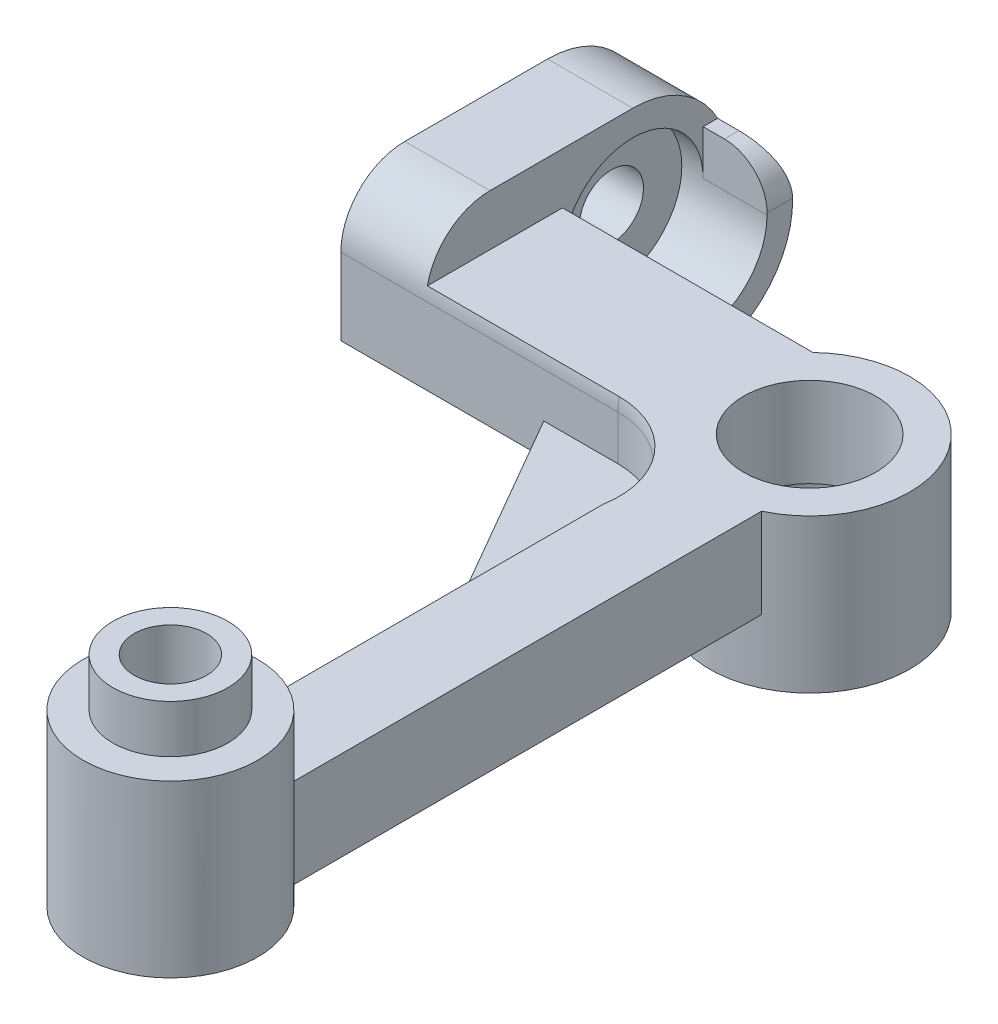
ISO-10303-21;
HEADER;
FILE_DESCRIPTION(('STEP AP214'),'2;1');
FILE_NAME('part.step','',(''),(''),'','','');
FILE_SCHEMA(('AUTOMOTIVE_DESIGN { 1 0 10303 214 1 1 1 1 }'));
ENDSEC;
DATA;
#1=APPLICATION_CONTEXT('core data for automotive mechanical design processes');
#2=APPLICATION_PROTOCOL_DEFINITION('international standard','automotive_design',2000,#1);
#3=PRODUCT_CONTEXT('',#1,'mechanical');
#4=PRODUCT('Part','Part','',(#3));
#5=PRODUCT_RELATED_PRODUCT_CATEGORY('part','',(#4));
#6=PRODUCT_DEFINITION_FORMATION('','',#4);
#7=PRODUCT_DEFINITION_CONTEXT('part definition',#1,'design');
#8=PRODUCT_DEFINITION('design','',#6,#7);
#9=PRODUCT_DEFINITION_SHAPE('','',#8);
#10=(LENGTH_UNIT() NAMED_UNIT(*) SI_UNIT(.MILLI.,.METRE.));
#11=(NAMED_UNIT(*) PLANE_ANGLE_UNIT() SI_UNIT($,.RADIAN.));
#12=(NAMED_UNIT(*) SI_UNIT($,.STERADIAN.) SOLID_ANGLE_UNIT());
#13=UNCERTAINTY_MEASURE_WITH_UNIT(LENGTH_MEASURE(1.E-05),#10,'distance_accuracy_value','');
#14=(GEOMETRIC_REPRESENTATION_CONTEXT(3) GLOBAL_UNCERTAINTY_ASSIGNED_CONTEXT((#13)) GLOBAL_UNIT_ASSIGNED_CONTEXT((#10,
#11,#12)) REPRESENTATION_CONTEXT('',''));
#15=CARTESIAN_POINT('',(0.,0.,0.));
#16=DIRECTION('',(0.,0.,1.));
#17=DIRECTION('',(1.,0.,0.));
#18=AXIS2_PLACEMENT_3D('',#15,#16,#17);
#19=CARTESIAN_POINT('',(0.,0.,30.));
#20=DIRECTION('',(0.,1.,0.));
#21=DIRECTION('',(0.,0.,1.));
#22=AXIS2_PLACEMENT_3D('',#19,#20,#21);
#23=PLANE('',#22);
#24=CARTESIAN_POINT('',(0.,0.,30.));
#25=DIRECTION('',(0.,1.,0.));
#26=DIRECTION('',(0.,0.,1.));
#27=AXIS2_PLACEMENT_3D('',#24,#25,#26);
#28=CIRCLE('',#27,1.7);
#29=CARTESIAN_POINT('',(0.,0.,31.7));
#30=VERTEX_POINT('',#29);
#31=EDGE_CURVE('E344',#30,#30,#28,.T.);
#32=ORIENTED_EDGE('',*,*,#31,.T.);
#33=EDGE_LOOP('',(#32));
#34=FACE_BOUND('',#33,.T.);
#35=DIRECTION('',(1.,0.,0.));
#36=VECTOR('',#35,1.);
#37=CARTESIAN_POINT('',(-19.,0.,-2.72005025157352));
#38=LINE('',#37,#36);
#39=CARTESIAN_POINT('',(-19.,0.,-2.72005025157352));
#40=VERTEX_POINT('',#39);
#41=CARTESIAN_POINT('',(-12.,0.,-2.72005025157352));
#42=VERTEX_POINT('',#41);
#43=EDGE_CURVE('E236',#40,#42,#38,.T.);
#44=ORIENTED_EDGE('',*,*,#43,.T.);
#45=DIRECTION('',(0.,0.,-1.));
#46=VECTOR('',#45,1.);
#47=CARTESIAN_POINT('',(-12.,0.,30.));
#48=LINE('',#47,#46);
#49=CARTESIAN_POINT('',(-12.,0.,-3.4));
#50=VERTEX_POINT('',#49);
#51=EDGE_CURVE('E207',#42,#50,#48,.T.);
#52=ORIENTED_EDGE('',*,*,#51,.T.);
#53=DIRECTION('',(-1.,0.,0.));
#54=VECTOR('',#53,1.);
#55=CARTESIAN_POINT('',(-3.2449961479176,0.,-3.4));
#56=LINE('',#55,#54);
#57=CARTESIAN_POINT('',(-3.2449961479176,0.,-3.4));
#58=VERTEX_POINT('',#57);
#59=EDGE_CURVE('E264',#58,#50,#56,.T.);
#60=ORIENTED_EDGE('',*,*,#59,.F.);
#61=CARTESIAN_POINT('',(0.,0.,0.));
#62=DIRECTION('',(0.,-1.,0.));
#63=DIRECTION('',(0.,0.,-1.));
#64=AXIS2_PLACEMENT_3D('',#61,#62,#63);
#65=CIRCLE('',#64,4.7);
#66=CARTESIAN_POINT('',(2.,0.,4.25323406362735));
#67=VERTEX_POINT('',#66);
#68=EDGE_CURVE('E240',#67,#58,#65,.T.);
#69=ORIENTED_EDGE('',*,*,#68,.F.);
#70=DIRECTION('',(0.,0.,-1.));
#71=VECTOR('',#70,1.);
#72=CARTESIAN_POINT('',(2.,0.,4.25323406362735));
#73=LINE('',#72,#71);
#74=CARTESIAN_POINT('',(2.,0.,26.4208939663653));
#75=VERTEX_POINT('',#74);
#76=EDGE_CURVE('E268',#75,#67,#73,.T.);
#77=ORIENTED_EDGE('',*,*,#76,.F.);
#78=CARTESIAN_POINT('',(0.,0.,30.));
#79=DIRECTION('',(0.,1.,0.));
#80=DIRECTION('',(0.,0.,1.));
#81=AXIS2_PLACEMENT_3D('',#78,#79,#80);
#82=CIRCLE('',#81,4.1);
#83=CARTESIAN_POINT('',(-2.,0.,26.4208939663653));
#84=VERTEX_POINT('',#83);
#85=EDGE_CURVE('E273',#84,#75,#82,.T.);
#86=ORIENTED_EDGE('',*,*,#85,.F.);
#87=DIRECTION('',(0.,0.,1.));
#88=VECTOR('',#87,1.);
#89=CARTESIAN_POINT('',(-2.,0.,7.00000000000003));
#90=LINE('',#89,#88);
#91=CARTESIAN_POINT('',(-2.,0.,15.95));
#92=VERTEX_POINT('',#91);
#93=EDGE_CURVE('E329',#92,#84,#90,.T.);
#94=ORIENTED_EDGE('',*,*,#93,.F.);
#95=DIRECTION('',(-0.500000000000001,0.,-0.866025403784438));
#96=VECTOR('',#95,1.);
#97=CARTESIAN_POINT('',(-9.47668598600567,0.,3.));
#98=LINE('',#97,#96);
#99=CARTESIAN_POINT('',(-9.47668598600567,0.,3.));
#100=VERTEX_POINT('',#99);
#101=EDGE_CURVE('E247',#92,#100,#98,.T.);
#102=ORIENTED_EDGE('',*,*,#101,.T.);
#103=DIRECTION('',(1.,0.,0.));
#104=VECTOR('',#103,1.);
#105=CARTESIAN_POINT('',(-6.00000000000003,0.,3.));
#106=LINE('',#105,#104);
#107=CARTESIAN_POINT('',(-19.,0.,3.00000000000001));
#108=VERTEX_POINT('',#107);
#109=EDGE_CURVE('E267',#108,#100,#106,.T.);
#110=ORIENTED_EDGE('',*,*,#109,.F.);
#111=DIRECTION('',(0.,0.,1.));
#112=VECTOR('',#111,1.);
#113=CARTESIAN_POINT('',(-19.,0.,-2.72005025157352));
#114=LINE('',#113,#112);
#115=EDGE_CURVE('E223',#40,#108,#114,.T.);
#116=ORIENTED_EDGE('',*,*,#115,.F.);
#117=EDGE_LOOP('',(#44,#52,#60,#69,#77,#86,#94,#102,#110,#116));
#118=FACE_BOUND('',#117,.T.);
#119=ADVANCED_FACE('F35',(#34,#118),#23,.F.);
#120=CARTESIAN_POINT('',(-15.,2.1,-6.7));
#121=DIRECTION('',(-1.,0.,0.));
#122=DIRECTION('',(0.,0.,1.));
#123=AXIS2_PLACEMENT_3D('',#120,#121,#122);
#124=PLANE('',#123);
#125=DIRECTION('',(0.,0.,-1.));
#126=VECTOR('',#125,1.);
#127=CARTESIAN_POINT('',(-15.,6.6,-6.7));
#128=LINE('',#127,#126);
#129=CARTESIAN_POINT('',(-15.,6.6,0.));
#130=VERTEX_POINT('',#129);
#131=CARTESIAN_POINT('',(-15.,6.6,-6.7));
#132=VERTEX_POINT('',#131);
#133=EDGE_CURVE('E224',#130,#132,#128,.T.);
#134=ORIENTED_EDGE('',*,*,#133,.F.);
#135=CARTESIAN_POINT('',(-15.,3.6,0.));
#136=DIRECTION('',(-1.,0.,0.));
#137=DIRECTION('',(0.,0.,1.));
#138=AXIS2_PLACEMENT_3D('',#135,#136,#137);
#139=CIRCLE('',#138,3.);
#140=CARTESIAN_POINT('',(-15.,4.2,2.93938769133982));
#141=VERTEX_POINT('',#140);
#142=EDGE_CURVE('E302',#130,#141,#139,.F.);
#143=ORIENTED_EDGE('',*,*,#142,.T.);
#144=DIRECTION('',(0.,0.,1.));
#145=VECTOR('',#144,1.);
#146=CARTESIAN_POINT('',(-15.,4.2,3.00000000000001));
#147=LINE('',#146,#145);
#148=CARTESIAN_POINT('',(-15.,4.2,-3.4));
#149=VERTEX_POINT('',#148);
#150=EDGE_CURVE('E281',#149,#141,#147,.T.);
#151=ORIENTED_EDGE('',*,*,#150,.F.);
#152=DIRECTION('',(0.,-1.,0.));
#153=VECTOR('',#152,1.);
#154=CARTESIAN_POINT('',(-15.,4.2,-3.4));
#155=LINE('',#154,#153);
#156=CARTESIAN_POINT('',(-15.,2.1,-3.4));
#157=VERTEX_POINT('',#156);
#158=EDGE_CURVE('E261',#149,#157,#155,.T.);
#159=ORIENTED_EDGE('',*,*,#158,.T.);
#160=CARTESIAN_POINT('',(-15.,2.1,-6.7));
#161=DIRECTION('',(1.,0.,0.));
#162=DIRECTION('',(0.,0.,-1.));
#163=AXIS2_PLACEMENT_3D('',#160,#161,#162);
#164=CIRCLE('',#163,3.3);
#165=CARTESIAN_POINT('',(-15.,2.1,-9.99999999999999));
#166=VERTEX_POINT('',#165);
#167=EDGE_CURVE('E210',#166,#157,#164,.T.);
#168=ORIENTED_EDGE('',*,*,#167,.F.);
#169=DIRECTION('',(0.,-1.,0.));
#170=VECTOR('',#169,1.);
#171=CARTESIAN_POINT('',(-15.,2.1,-9.99999999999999));
#172=LINE('',#171,#170);
#173=CARTESIAN_POINT('',(-15.,4.2,-9.99999999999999));
#174=VERTEX_POINT('',#173);
#175=EDGE_CURVE('E186',#174,#166,#172,.T.);
#176=ORIENTED_EDGE('',*,*,#175,.F.);
#177=DIRECTION('',(0.,0.,1.));
#178=VECTOR('',#177,1.);
#179=CARTESIAN_POINT('',(-15.,4.2,-9.99999999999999));
#180=LINE('',#179,#178);
#181=CARTESIAN_POINT('',(-15.,4.2,-10.6799497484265));
#182=VERTEX_POINT('',#181);
#183=EDGE_CURVE('E199',#182,#174,#180,.T.);
#184=ORIENTED_EDGE('',*,*,#183,.F.);
#185=CARTESIAN_POINT('',(-15.,2.1,-6.7));
#186=DIRECTION('',(-1.,0.,0.));
#187=DIRECTION('',(0.,0.,1.));
#188=AXIS2_PLACEMENT_3D('',#185,#186,#187);
#189=CIRCLE('',#188,4.5);
#190=EDGE_CURVE('E219',#132,#182,#189,.T.);
#191=ORIENTED_EDGE('',*,*,#190,.F.);
#192=EDGE_LOOP('',(#134,#143,#151,#159,#168,#176,#184,#191));
#193=FACE_BOUND('',#192,.T.);
#194=ADVANCED_FACE('F437',(#193),#124,.F.);
#195=CARTESIAN_POINT('',(-19.,2.1,-6.7));
#196=DIRECTION('',(1.,0.,0.));
#197=DIRECTION('',(0.,0.,-1.));
#198=AXIS2_PLACEMENT_3D('',#195,#196,#197);
#199=CYLINDRICAL_SURFACE('',#198,1.5);
#200=CARTESIAN_POINT('',(-19.,2.1,-6.7));
#201=DIRECTION('',(-1.,0.,0.));
#202=DIRECTION('',(0.,0.,1.));
#203=AXIS2_PLACEMENT_3D('',#200,#201,#202);
#204=CIRCLE('',#203,1.5);
#205=CARTESIAN_POINT('',(-19.,2.1,-5.2));
#206=VERTEX_POINT('',#205);
#207=EDGE_CURVE('E216',#206,#206,#204,.T.);
#208=ORIENTED_EDGE('',*,*,#207,.T.);
#209=EDGE_LOOP('',(#208));
#210=FACE_BOUND('',#209,.T.);
#211=CARTESIAN_POINT('',(-16.,2.1,-6.7));
#212=DIRECTION('',(1.,0.,0.));
#213=DIRECTION('',(0.,0.,-1.));
#214=AXIS2_PLACEMENT_3D('',#211,#212,#213);
#215=CIRCLE('',#214,1.5);
#216=CARTESIAN_POINT('',(-16.,2.1,-8.2));
#217=VERTEX_POINT('',#216);
#218=EDGE_CURVE('E214',#217,#217,#215,.T.);
#219=ORIENTED_EDGE('',*,*,#218,.T.);
#220=EDGE_LOOP('',(#219));
#221=FACE_BOUND('',#220,.T.);
#222=ADVANCED_FACE('F442',(#210,#221),#199,.F.);
#223=CARTESIAN_POINT('',(0.,0.,0.));
#224=DIRECTION('',(0.,1.,0.));
#225=DIRECTION('',(0.,0.,1.));
#226=AXIS2_PLACEMENT_3D('',#223,#224,#225);
#227=CIRCLE('',#226,3.1);
#228=CARTESIAN_POINT('',(0.,0.,3.1));
#229=VERTEX_POINT('',#228);
#230=EDGE_CURVE('E347',#229,#229,#227,.T.);
#231=ORIENTED_EDGE('',*,*,#230,.T.);
#232=EDGE_LOOP('',(#231));
#233=FACE_BOUND('',#232,.T.);
#234=CARTESIAN_POINT('',(0.,0.,0.));
#235=DIRECTION('',(0.,-1.,0.));
#236=DIRECTION('',(0.,0.,-1.));
#237=AXIS2_PLACEMENT_3D('',#234,#235,#236);
#238=CIRCLE('',#237,3.2);
#239=CARTESIAN_POINT('',(0.,0.,-3.2));
#240=VERTEX_POINT('',#239);
#241=EDGE_CURVE('E241',#240,#240,#238,.T.);
#242=ORIENTED_EDGE('',*,*,#241,.T.);
#243=EDGE_LOOP('',(#242));
#244=FACE_BOUND('',#243,.T.);
#245=ADVANCED_FACE('F417',(#233,#244),#23,.F.);
#246=CARTESIAN_POINT('',(-6.,4.2,7.00000000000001));
#247=DIRECTION('',(0.,-1.,0.));
#248=DIRECTION('',(0.,0.,-1.));
#249=AXIS2_PLACEMENT_3D('',#246,#247,#248);
#250=CYLINDRICAL_SURFACE('',#249,4.);
#251=DIRECTION('',(0.,-1.,0.));
#252=VECTOR('',#251,1.);
#253=CARTESIAN_POINT('',(-2.,4.2,7.00000000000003));
#254=LINE('',#253,#252);
#255=CARTESIAN_POINT('',(-2.,3.6,7.00000000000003));
#256=VERTEX_POINT('',#255);
#257=CARTESIAN_POINT('',(-2.,1.5,7.00000000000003));
#258=VERTEX_POINT('',#257);
#259=EDGE_CURVE('E315',#256,#258,#254,.T.);
#260=ORIENTED_EDGE('',*,*,#259,.F.);
#261=CARTESIAN_POINT('',(-6.,3.6,7.00000000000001));
#262=DIRECTION('',(0.,-1.,0.));
#263=DIRECTION('',(0.,0.,-1.));
#264=AXIS2_PLACEMENT_3D('',#261,#262,#263);
#265=CIRCLE('',#264,4.);
#266=CARTESIAN_POINT('',(-6.00000000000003,3.6,3.));
#267=VERTEX_POINT('',#266);
#268=EDGE_CURVE('E394',#256,#267,#265,.F.);
#269=ORIENTED_EDGE('',*,*,#268,.T.);
#270=DIRECTION('',(0.,-1.,0.));
#271=VECTOR('',#270,1.);
#272=CARTESIAN_POINT('',(-6.00000000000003,4.2,3.));
#273=LINE('',#272,#271);
#274=CARTESIAN_POINT('',(-6.00000000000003,1.5,3.));
#275=VERTEX_POINT('',#274);
#276=EDGE_CURVE('E322',#267,#275,#273,.T.);
#277=ORIENTED_EDGE('',*,*,#276,.T.);
#278=CARTESIAN_POINT('',(-6.,1.5,7.00000000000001));
#279=DIRECTION('',(0.,-1.,0.));
#280=DIRECTION('',(0.,0.,-1.));
#281=AXIS2_PLACEMENT_3D('',#278,#279,#280);
#282=CIRCLE('',#281,4.);
#283=EDGE_CURVE('E755',#258,#275,#282,.F.);
#284=ORIENTED_EDGE('',*,*,#283,.F.);
#285=EDGE_LOOP('',(#260,#269,#277,#284));
#286=FACE_BOUND('',#285,.T.);
#287=ADVANCED_FACE('F413',(#286),#250,.F.);
#288=CARTESIAN_POINT('',(0.,8.,30.));
#289=DIRECTION('',(0.,1.,0.));
#290=DIRECTION('',(0.,0.,1.));
#291=AXIS2_PLACEMENT_3D('',#288,#289,#290);
#292=PLANE('',#291);
#293=CARTESIAN_POINT('',(0.,8.,30.));
#294=DIRECTION('',(0.,1.,0.));
#295=DIRECTION('',(0.,0.,1.));
#296=AXIS2_PLACEMENT_3D('',#293,#294,#295);
#297=CIRCLE('',#296,4.1);
#298=CARTESIAN_POINT('',(0.,8.,34.1));
#299=VERTEX_POINT('',#298);
#300=EDGE_CURVE('E341',#299,#299,#297,.T.);
#301=ORIENTED_EDGE('',*,*,#300,.T.);
#302=EDGE_LOOP('',(#301));
#303=FACE_BOUND('',#302,.T.);
#304=CARTESIAN_POINT('',(0.,8.,30.));
#305=DIRECTION('',(0.,1.,0.));
#306=DIRECTION('',(0.,0.,1.));
#307=AXIS2_PLACEMENT_3D('',#304,#305,#306);
#308=CIRCLE('',#307,2.7);
#309=CARTESIAN_POINT('',(0.,8.,32.7));
#310=VERTEX_POINT('',#309);
#311=EDGE_CURVE('E759',#310,#310,#308,.T.);
#312=ORIENTED_EDGE('',*,*,#311,.F.);
#313=EDGE_LOOP('',(#312));
#314=FACE_BOUND('',#313,.T.);
#315=ADVANCED_FACE('F416',(#303,#314),#292,.T.);
#316=CARTESIAN_POINT('',(0.,4.2,30.));
#317=DIRECTION('',(0.,1.,0.));
#318=DIRECTION('',(0.,0.,1.));
#319=AXIS2_PLACEMENT_3D('',#316,#317,#318);
#320=PLANE('',#319);
#321=ORIENTED_EDGE('',*,*,#150,.T.);
#322=DIRECTION('',(1.,0.,0.));
#323=VECTOR('',#322,1.);
#324=CARTESIAN_POINT('',(-15.,4.2,2.93938769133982));
#325=LINE('',#324,#323);
#326=CARTESIAN_POINT('',(-6.00000000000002,4.2,2.93938769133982));
#327=VERTEX_POINT('',#326);
#328=EDGE_CURVE('E383',#141,#327,#325,.T.);
#329=ORIENTED_EDGE('',*,*,#328,.T.);
#330=CARTESIAN_POINT('',(-6.,4.2,7.00000000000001));
#331=DIRECTION('',(0.,-1.,0.));
#332=DIRECTION('',(0.,0.,-1.));
#333=AXIS2_PLACEMENT_3D('',#330,#331,#332);
#334=CIRCLE('',#333,4.06061230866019);
#335=CARTESIAN_POINT('',(-2.,4.2,7.69897948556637));
#336=VERTEX_POINT('',#335);
#337=EDGE_CURVE('E304',#327,#336,#334,.T.);
#338=ORIENTED_EDGE('',*,*,#337,.T.);
#339=DIRECTION('',(0.,0.,1.));
#340=VECTOR('',#339,1.);
#341=CARTESIAN_POINT('',(-2.,4.2,7.00000000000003));
#342=LINE('',#341,#340);
#343=CARTESIAN_POINT('',(-2.,4.2,26.4208939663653));
#344=VERTEX_POINT('',#343);
#345=EDGE_CURVE('E284',#336,#344,#342,.T.);
#346=ORIENTED_EDGE('',*,*,#345,.T.);
#347=CARTESIAN_POINT('',(0.,4.2,30.));
#348=DIRECTION('',(0.,1.,0.));
#349=DIRECTION('',(0.,0.,1.));
#350=AXIS2_PLACEMENT_3D('',#347,#348,#349);
#351=CIRCLE('',#350,4.1);
#352=CARTESIAN_POINT('',(2.,4.2,26.4208939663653));
#353=VERTEX_POINT('',#352);
#354=EDGE_CURVE('E338',#353,#344,#351,.T.);
#355=ORIENTED_EDGE('',*,*,#354,.F.);
#356=DIRECTION('',(0.,0.,-1.));
#357=VECTOR('',#356,1.);
#358=CARTESIAN_POINT('',(2.,4.2,4.25323406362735));
#359=LINE('',#358,#357);
#360=CARTESIAN_POINT('',(2.,4.2,4.25323406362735));
#361=VERTEX_POINT('',#360);
#362=EDGE_CURVE('E355',#353,#361,#359,.T.);
#363=ORIENTED_EDGE('',*,*,#362,.T.);
#364=CARTESIAN_POINT('',(0.,4.2,0.));
#365=DIRECTION('',(0.,1.,0.));
#366=DIRECTION('',(0.,0.,1.));
#367=AXIS2_PLACEMENT_3D('',#364,#365,#366);
#368=CIRCLE('',#367,4.7);
#369=CARTESIAN_POINT('',(-3.2449961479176,4.2,-3.4));
#370=VERTEX_POINT('',#369);
#371=EDGE_CURVE('E353',#361,#370,#368,.T.);
#372=ORIENTED_EDGE('',*,*,#371,.T.);
#373=DIRECTION('',(-1.,0.,0.));
#374=VECTOR('',#373,1.);
#375=CARTESIAN_POINT('',(-3.2449961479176,4.2,-3.4));
#376=LINE('',#375,#374);
#377=EDGE_CURVE('E285',#370,#149,#376,.T.);
#378=ORIENTED_EDGE('',*,*,#377,.T.);
#379=EDGE_LOOP('',(#321,#329,#338,#346,#355,#363,#372,#378));
#380=FACE_BOUND('',#379,.T.);
#381=CARTESIAN_POINT('',(0.,4.2,0.));
#382=DIRECTION('',(0.,1.,0.));
#383=DIRECTION('',(0.,0.,1.));
#384=AXIS2_PLACEMENT_3D('',#381,#382,#383);
#385=CIRCLE('',#384,3.1);
#386=CARTESIAN_POINT('',(0.,4.2,3.1));
#387=VERTEX_POINT('',#386);
#388=EDGE_CURVE('E348',#387,#387,#385,.T.);
#389=ORIENTED_EDGE('',*,*,#388,.F.);
#390=EDGE_LOOP('',(#389));
#391=FACE_BOUND('',#390,.T.);
#392=ADVANCED_FACE('F366',(#380,#391),#320,.T.);
#393=CARTESIAN_POINT('',(0.,4.2,30.));
#394=DIRECTION('',(0.,-1.,0.));
#395=DIRECTION('',(0.,0.,-1.));
#396=AXIS2_PLACEMENT_3D('',#393,#394,#395);
#397=CYLINDRICAL_SURFACE('',#396,4.1);
#398=ORIENTED_EDGE('',*,*,#85,.T.);
#399=DIRECTION('',(0.,-1.,0.));
#400=VECTOR('',#399,1.);
#401=CARTESIAN_POINT('',(2.,4.2,26.4208939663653));
#402=LINE('',#401,#400);
#403=EDGE_CURVE('E278',#353,#75,#402,.T.);
#404=ORIENTED_EDGE('',*,*,#403,.F.);
#405=ORIENTED_EDGE('',*,*,#354,.T.);
#406=DIRECTION('',(0.,-1.,0.));
#407=VECTOR('',#406,1.);
#408=CARTESIAN_POINT('',(-2.,4.2,26.4208939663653));
#409=LINE('',#408,#407);
#410=EDGE_CURVE('E307',#344,#84,#409,.T.);
#411=ORIENTED_EDGE('',*,*,#410,.T.);
#412=EDGE_LOOP('',(#398,#404,#405,#411));
#413=FACE_BOUND('',#412,.T.);
#414=ORIENTED_EDGE('',*,*,#300,.F.);
#415=EDGE_LOOP('',(#414));
#416=FACE_BOUND('',#415,.T.);
#417=ADVANCED_FACE('F427',(#413,#416),#397,.T.);
#418=CARTESIAN_POINT('',(2.,4.2,4.25323406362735));
#419=DIRECTION('',(-1.,0.,0.));
#420=DIRECTION('',(0.,0.,1.));
#421=AXIS2_PLACEMENT_3D('',#418,#419,#420);
#422=PLANE('',#421);
#423=ORIENTED_EDGE('',*,*,#76,.T.);
#424=DIRECTION('',(0.,-1.,0.));
#425=VECTOR('',#424,1.);
#426=CARTESIAN_POINT('',(2.,4.2,4.25323406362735));
#427=LINE('',#426,#425);
#428=EDGE_CURVE('E260',#361,#67,#427,.T.);
#429=ORIENTED_EDGE('',*,*,#428,.F.);
#430=ORIENTED_EDGE('',*,*,#362,.F.);
#431=ORIENTED_EDGE('',*,*,#403,.T.);
#432=EDGE_LOOP('',(#423,#429,#430,#431));
#433=FACE_BOUND('',#432,.T.);
#434=ADVANCED_FACE('F372',(#433),#422,.F.);
#435=CARTESIAN_POINT('',(0.,4.2,0.));
#436=DIRECTION('',(0.,-1.,0.));
#437=DIRECTION('',(0.,0.,-1.));
#438=AXIS2_PLACEMENT_3D('',#435,#436,#437);
#439=CYLINDRICAL_SURFACE('',#438,4.7);
#440=ORIENTED_EDGE('',*,*,#428,.T.);
#441=ORIENTED_EDGE('',*,*,#68,.T.);
#442=DIRECTION('',(0.,-1.,0.));
#443=VECTOR('',#442,1.);
#444=CARTESIAN_POINT('',(-3.2449961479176,4.2,-3.4));
#445=LINE('',#444,#443);
#446=EDGE_CURVE('E257',#370,#58,#445,.T.);
#447=ORIENTED_EDGE('',*,*,#446,.F.);
#448=ORIENTED_EDGE('',*,*,#371,.F.);
#449=EDGE_LOOP('',(#440,#441,#447,#448));
#450=FACE_BOUND('',#449,.T.);
#451=CARTESIAN_POINT('',(0.,-3.,0.));
#452=DIRECTION('',(0.,-1.,0.));
#453=DIRECTION('',(0.,0.,-1.));
#454=AXIS2_PLACEMENT_3D('',#451,#452,#453);
#455=CIRCLE('',#454,4.7);
#456=CARTESIAN_POINT('',(0.,-3.,-4.7));
#457=VERTEX_POINT('',#456);
#458=EDGE_CURVE('E244',#457,#457,#455,.T.);
#459=ORIENTED_EDGE('',*,*,#458,.F.);
#460=EDGE_LOOP('',(#459));
#461=FACE_BOUND('',#460,.T.);
#462=ADVANCED_FACE('F374',(#450,#461),#439,.T.);
#463=CARTESIAN_POINT('',(-3.2449961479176,4.2,-3.4));
#464=DIRECTION('',(0.,0.,1.));
#465=DIRECTION('',(1.,0.,0.));
#466=AXIS2_PLACEMENT_3D('',#463,#464,#465);
#467=PLANE('',#466);
#468=ORIENTED_EDGE('',*,*,#59,.T.);
#469=DIRECTION('',(0.,1.,0.));
#470=VECTOR('',#469,1.);
#471=CARTESIAN_POINT('',(-12.,4.2,-3.4));
#472=LINE('',#471,#470);
#473=CARTESIAN_POINT('',(-12.,2.1,-3.4));
#474=VERTEX_POINT('',#473);
#475=EDGE_CURVE('E297',#50,#474,#472,.T.);
#476=ORIENTED_EDGE('',*,*,#475,.T.);
#477=DIRECTION('',(-1.,0.,0.));
#478=VECTOR('',#477,1.);
#479=CARTESIAN_POINT('',(-12.,2.1,-3.4));
#480=LINE('',#479,#478);
#481=EDGE_CURVE('E191',#474,#157,#480,.T.);
#482=ORIENTED_EDGE('',*,*,#481,.T.);
#483=ORIENTED_EDGE('',*,*,#158,.F.);
#484=ORIENTED_EDGE('',*,*,#377,.F.);
#485=ORIENTED_EDGE('',*,*,#446,.T.);
#486=EDGE_LOOP('',(#468,#476,#482,#483,#484,#485));
#487=FACE_BOUND('',#486,.T.);
#488=ADVANCED_FACE('F380',(#487),#467,.F.);
#489=CARTESIAN_POINT('',(-6.00000000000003,4.2,3.));
#490=DIRECTION('',(0.,0.,-1.));
#491=DIRECTION('',(-1.,0.,0.));
#492=AXIS2_PLACEMENT_3D('',#489,#490,#491);
#493=PLANE('',#492);
#494=ORIENTED_EDGE('',*,*,#276,.F.);
#495=DIRECTION('',(1.,0.,0.));
#496=VECTOR('',#495,1.);
#497=CARTESIAN_POINT('',(-6.00000000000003,3.6,3.));
#498=LINE('',#497,#496);
#499=CARTESIAN_POINT('',(-19.,3.6,3.));
#500=VERTEX_POINT('',#499);
#501=EDGE_CURVE('E739',#267,#500,#498,.F.);
#502=ORIENTED_EDGE('',*,*,#501,.T.);
#503=DIRECTION('',(0.,1.,0.));
#504=VECTOR('',#503,1.);
#505=CARTESIAN_POINT('',(-19.,0.,3.00000000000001));
#506=LINE('',#505,#504);
#507=EDGE_CURVE('E227',#108,#500,#506,.T.);
#508=ORIENTED_EDGE('',*,*,#507,.F.);
#509=ORIENTED_EDGE('',*,*,#109,.T.);
#510=DIRECTION('',(0.,-1.,0.));
#511=VECTOR('',#510,1.);
#512=CARTESIAN_POINT('',(-9.47668598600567,1.5,3.));
#513=LINE('',#512,#511);
#514=CARTESIAN_POINT('',(-9.47668598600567,1.5,3.));
#515=VERTEX_POINT('',#514);
#516=EDGE_CURVE('E750',#515,#100,#513,.T.);
#517=ORIENTED_EDGE('',*,*,#516,.F.);
#518=DIRECTION('',(1.,0.,0.));
#519=VECTOR('',#518,1.);
#520=CARTESIAN_POINT('',(-2.,1.5,3.));
#521=LINE('',#520,#519);
#522=EDGE_CURVE('E250',#515,#275,#521,.T.);
#523=ORIENTED_EDGE('',*,*,#522,.T.);
#524=EDGE_LOOP('',(#494,#502,#508,#509,#517,#523));
#525=FACE_BOUND('',#524,.T.);
#526=ADVANCED_FACE('F411',(#525),#493,.F.);
#527=CARTESIAN_POINT('',(-2.,4.2,7.00000000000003));
#528=DIRECTION('',(1.,0.,0.));
#529=DIRECTION('',(0.,0.,-1.));
#530=AXIS2_PLACEMENT_3D('',#527,#528,#529);
#531=PLANE('',#530);
#532=ORIENTED_EDGE('',*,*,#345,.F.);
#533=CARTESIAN_POINT('',(-2.,4.2,7.69897948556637));
#534=CARTESIAN_POINT('',(-2.,4.10237899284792,7.58321865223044));
#535=CARTESIAN_POINT('',(-2.,4.00401303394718,7.46809592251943));
#536=CARTESIAN_POINT('',(-2.,3.80652812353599,7.23849961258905));
#537=CARTESIAN_POINT('',(-2.00000000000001,3.70740918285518,7.12402602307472));
#538=CARTESIAN_POINT('',(-2.,3.60552052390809,7.00637455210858));
#539=CARTESIAN_POINT('',(-2.,3.60276026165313,7.00318727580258));
#540=CARTESIAN_POINT('',(-2.,3.6,7.00000000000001));
#541=B_SPLINE_CURVE_WITH_KNOTS('',3,(#533,#534,#535,#536,#537,#538,#539,#540),.UNSPECIFIED.,.F.,
.F.,(4,2,2,4),(0.,0.454271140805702,0.908535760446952,0.92118487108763),.UNSPECIFIED.);
#542=EDGE_CURVE('E393',#336,#256,#541,.T.);
#543=ORIENTED_EDGE('',*,*,#542,.T.);
#544=ORIENTED_EDGE('',*,*,#259,.T.);
#545=DIRECTION('',(0.,0.,-1.));
#546=VECTOR('',#545,1.);
#547=CARTESIAN_POINT('',(-2.,1.5,7.00000000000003));
#548=LINE('',#547,#546);
#549=CARTESIAN_POINT('',(-2.,1.5,15.95));
#550=VERTEX_POINT('',#549);
#551=EDGE_CURVE('E255',#550,#258,#548,.T.);
#552=ORIENTED_EDGE('',*,*,#551,.F.);
#553=DIRECTION('',(0.,-1.,0.));
#554=VECTOR('',#553,1.);
#555=CARTESIAN_POINT('',(-2.,1.5,15.95));
#556=LINE('',#555,#554);
#557=EDGE_CURVE('E761',#550,#92,#556,.T.);
#558=ORIENTED_EDGE('',*,*,#557,.T.);
#559=ORIENTED_EDGE('',*,*,#93,.T.);
#560=ORIENTED_EDGE('',*,*,#410,.F.);
#561=EDGE_LOOP('',(#532,#543,#544,#552,#558,#559,#560));
#562=FACE_BOUND('',#561,.T.);
#563=ADVANCED_FACE('F405',(#562),#531,.F.);
#564=CARTESIAN_POINT('',(0.,4.2,0.));
#565=DIRECTION('',(0.,-1.,0.));
#566=DIRECTION('',(0.,0.,-1.));
#567=AXIS2_PLACEMENT_3D('',#564,#565,#566);
#568=CYLINDRICAL_SURFACE('',#567,3.1);
#569=ORIENTED_EDGE('',*,*,#388,.T.);
#570=EDGE_LOOP('',(#569));
#571=FACE_BOUND('',#570,.T.);
#572=ORIENTED_EDGE('',*,*,#230,.F.);
#573=EDGE_LOOP('',(#572));
#574=FACE_BOUND('',#573,.T.);
#575=ADVANCED_FACE('F410',(#571,#574),#568,.F.);
#576=CARTESIAN_POINT('',(0.,4.2,30.));
#577=DIRECTION('',(0.,-1.,0.));
#578=DIRECTION('',(0.,0.,-1.));
#579=AXIS2_PLACEMENT_3D('',#576,#577,#578);
#580=CYLINDRICAL_SURFACE('',#579,1.7);
#581=ORIENTED_EDGE('',*,*,#31,.F.);
#582=EDGE_LOOP('',(#581));
#583=FACE_BOUND('',#582,.T.);
#584=CARTESIAN_POINT('',(0.,10.25,30.));
#585=DIRECTION('',(0.,1.,0.));
#586=DIRECTION('',(0.,0.,1.));
#587=AXIS2_PLACEMENT_3D('',#584,#585,#586);
#588=CIRCLE('',#587,1.7);
#589=CARTESIAN_POINT('',(0.,10.25,31.7));
#590=VERTEX_POINT('',#589);
#591=EDGE_CURVE('E756',#590,#590,#588,.T.);
#592=ORIENTED_EDGE('',*,*,#591,.T.);
#593=EDGE_LOOP('',(#592));
#594=FACE_BOUND('',#593,.T.);
#595=ADVANCED_FACE('F486',(#583,#594),#580,.F.);
#596=CARTESIAN_POINT('',(0.,10.25,30.));
#597=DIRECTION('',(0.,1.,0.));
#598=DIRECTION('',(0.,0.,1.));
#599=AXIS2_PLACEMENT_3D('',#596,#597,#598);
#600=PLANE('',#599);
#601=CARTESIAN_POINT('',(0.,10.25,30.));
#602=DIRECTION('',(0.,1.,0.));
#603=DIRECTION('',(0.,0.,1.));
#604=AXIS2_PLACEMENT_3D('',#601,#602,#603);
#605=CIRCLE('',#604,2.7);
#606=CARTESIAN_POINT('',(0.,10.25,32.7));
#607=VERTEX_POINT('',#606);
#608=EDGE_CURVE('E342',#607,#607,#605,.T.);
#609=ORIENTED_EDGE('',*,*,#608,.T.);
#610=EDGE_LOOP('',(#609));
#611=FACE_BOUND('',#610,.T.);
#612=ORIENTED_EDGE('',*,*,#591,.F.);
#613=EDGE_LOOP('',(#612));
#614=FACE_BOUND('',#613,.T.);
#615=ADVANCED_FACE('F483',(#611,#614),#600,.T.);
#616=CARTESIAN_POINT('',(0.,10.25,30.));
#617=DIRECTION('',(0.,-1.,0.));
#618=DIRECTION('',(0.,0.,-1.));
#619=AXIS2_PLACEMENT_3D('',#616,#617,#618);
#620=CYLINDRICAL_SURFACE('',#619,2.7);
#621=ORIENTED_EDGE('',*,*,#608,.F.);
#622=EDGE_LOOP('',(#621));
#623=FACE_BOUND('',#622,.T.);
#624=ORIENTED_EDGE('',*,*,#311,.T.);
#625=EDGE_LOOP('',(#624));
#626=FACE_BOUND('',#625,.T.);
#627=ADVANCED_FACE('F478',(#623,#626),#620,.T.);
#628=CARTESIAN_POINT('',(0.,1.5,0.));
#629=DIRECTION('',(0.,-1.,0.));
#630=DIRECTION('',(0.,0.,-1.));
#631=AXIS2_PLACEMENT_3D('',#628,#629,#630);
#632=PLANE('',#631);
#633=ORIENTED_EDGE('',*,*,#551,.T.);
#634=ORIENTED_EDGE('',*,*,#283,.T.);
#635=ORIENTED_EDGE('',*,*,#522,.F.);
#636=DIRECTION('',(-0.500000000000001,0.,-0.866025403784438));
#637=VECTOR('',#636,1.);
#638=CARTESIAN_POINT('',(-9.47668598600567,1.5,3.));
#639=LINE('',#638,#637);
#640=EDGE_CURVE('E753',#550,#515,#639,.T.);
#641=ORIENTED_EDGE('',*,*,#640,.F.);
#642=EDGE_LOOP('',(#633,#634,#635,#641));
#643=FACE_BOUND('',#642,.T.);
#644=ADVANCED_FACE('F475',(#643),#632,.F.);
#645=CARTESIAN_POINT('',(-9.47668598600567,1.5,3.));
#646=DIRECTION('',(-0.866025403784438,0.,0.500000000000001));
#647=DIRECTION('',(0.500000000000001,0.,0.866025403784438));
#648=AXIS2_PLACEMENT_3D('',#645,#646,#647);
#649=PLANE('',#648);
#650=ORIENTED_EDGE('',*,*,#101,.F.);
#651=ORIENTED_EDGE('',*,*,#557,.F.);
#652=ORIENTED_EDGE('',*,*,#640,.T.);
#653=ORIENTED_EDGE('',*,*,#516,.T.);
#654=EDGE_LOOP('',(#650,#651,#652,#653));
#655=FACE_BOUND('',#654,.T.);
#656=ADVANCED_FACE('F469',(#655),#649,.T.);
#657=CARTESIAN_POINT('',(0.,-3.,0.));
#658=DIRECTION('',(0.,-1.,0.));
#659=DIRECTION('',(0.,0.,-1.));
#660=AXIS2_PLACEMENT_3D('',#657,#658,#659);
#661=PLANE('',#660);
#662=ORIENTED_EDGE('',*,*,#458,.T.);
#663=EDGE_LOOP('',(#662));
#664=FACE_BOUND('',#663,.T.);
#665=CARTESIAN_POINT('',(0.,-3.,0.));
#666=DIRECTION('',(0.,-1.,0.));
#667=DIRECTION('',(0.,0.,-1.));
#668=AXIS2_PLACEMENT_3D('',#665,#666,#667);
#669=CIRCLE('',#668,3.2);
#670=CARTESIAN_POINT('',(0.,-3.,-3.2));
#671=VERTEX_POINT('',#670);
#672=EDGE_CURVE('E237',#671,#671,#669,.T.);
#673=ORIENTED_EDGE('',*,*,#672,.F.);
#674=EDGE_LOOP('',(#673));
#675=FACE_BOUND('',#674,.T.);
#676=ADVANCED_FACE('F459',(#664,#675),#661,.T.);
#677=CARTESIAN_POINT('',(0.,-3.,0.));
#678=DIRECTION('',(0.,1.,0.));
#679=DIRECTION('',(0.,0.,1.));
#680=AXIS2_PLACEMENT_3D('',#677,#678,#679);
#681=CYLINDRICAL_SURFACE('',#680,3.2);
#682=ORIENTED_EDGE('',*,*,#672,.T.);
#683=EDGE_LOOP('',(#682));
#684=FACE_BOUND('',#683,.T.);
#685=ORIENTED_EDGE('',*,*,#241,.F.);
#686=EDGE_LOOP('',(#685));
#687=FACE_BOUND('',#686,.T.);
#688=ADVANCED_FACE('F456',(#684,#687),#681,.F.);
#689=CARTESIAN_POINT('',(-19.,2.1,-6.7));
#690=DIRECTION('',(-1.,0.,0.));
#691=DIRECTION('',(0.,0.,1.));
#692=AXIS2_PLACEMENT_3D('',#689,#690,#691);
#693=PLANE('',#692);
#694=ORIENTED_EDGE('',*,*,#507,.T.);
#695=CARTESIAN_POINT('',(-19.,3.6,0.));
#696=DIRECTION('',(-1.,0.,0.));
#697=DIRECTION('',(0.,0.,1.));
#698=AXIS2_PLACEMENT_3D('',#695,#696,#697);
#699=CIRCLE('',#698,3.);
#700=CARTESIAN_POINT('',(-19.,6.6,0.));
#701=VERTEX_POINT('',#700);
#702=EDGE_CURVE('E738',#500,#701,#699,.T.);
#703=ORIENTED_EDGE('',*,*,#702,.T.);
#704=DIRECTION('',(0.,0.,-1.));
#705=VECTOR('',#704,1.);
#706=CARTESIAN_POINT('',(-19.,6.6,-6.7));
#707=LINE('',#706,#705);
#708=CARTESIAN_POINT('',(-19.,6.6,-6.7));
#709=VERTEX_POINT('',#708);
#710=EDGE_CURVE('E230',#701,#709,#707,.T.);
#711=ORIENTED_EDGE('',*,*,#710,.T.);
#712=CARTESIAN_POINT('',(-19.,2.1,-6.7));
#713=DIRECTION('',(-1.,0.,0.));
#714=DIRECTION('',(0.,0.,1.));
#715=AXIS2_PLACEMENT_3D('',#712,#713,#714);
#716=CIRCLE('',#715,4.5);
#717=EDGE_CURVE('E220',#709,#40,#716,.T.);
#718=ORIENTED_EDGE('',*,*,#717,.T.);
#719=ORIENTED_EDGE('',*,*,#115,.T.);
#720=EDGE_LOOP('',(#694,#703,#711,#718,#719));
#721=FACE_BOUND('',#720,.T.);
#722=ORIENTED_EDGE('',*,*,#207,.F.);
#723=EDGE_LOOP('',(#722));
#724=FACE_BOUND('',#723,.T.);
#725=ADVANCED_FACE('F458',(#721,#724),#693,.T.);
#726=CARTESIAN_POINT('',(-19.,2.1,-6.7));
#727=DIRECTION('',(1.,0.,0.));
#728=DIRECTION('',(0.,0.,-1.));
#729=AXIS2_PLACEMENT_3D('',#726,#727,#728);
#730=CYLINDRICAL_SURFACE('',#729,4.5);
#731=DIRECTION('',(-1.,0.,0.));
#732=VECTOR('',#731,1.);
#733=CARTESIAN_POINT('',(-12.,4.2,-10.6799497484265));
#734=LINE('',#733,#732);
#735=CARTESIAN_POINT('',(-14.,4.2,-10.6799497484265));
#736=VERTEX_POINT('',#735);
#737=EDGE_CURVE('E205',#736,#182,#734,.T.);
#738=ORIENTED_EDGE('',*,*,#737,.F.);
#739=CARTESIAN_POINT('',(-14.,4.2,-10.6799497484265));
#740=CARTESIAN_POINT('',(-13.9471595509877,4.20000889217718,-10.6799364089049));
#741=CARTESIAN_POINT('',(-13.8943265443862,4.19790619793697,-10.6810543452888));
#742=CARTESIAN_POINT('',(-13.7891071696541,4.18954735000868,-10.6854525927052));
#743=CARTESIAN_POINT('',(-13.7367205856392,4.18329333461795,-10.6887317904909));
#744=CARTESIAN_POINT('',(-13.633036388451,4.1667438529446,-10.6973305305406));
#745=CARTESIAN_POINT('',(-13.5817345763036,4.15646921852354,-10.7026395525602));
#746=CARTESIAN_POINT('',(-13.4803136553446,4.13200689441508,-10.7151134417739));
#747=CARTESIAN_POINT('',(-13.4301946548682,4.11781884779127,-10.7222784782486));
#748=CARTESIAN_POINT('',(-13.2822746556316,4.06964959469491,-10.7462049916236));
#749=CARTESIAN_POINT('',(-13.1866437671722,4.03001984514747,-10.7654218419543));
#750=CARTESIAN_POINT('',(-13.0033453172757,3.93703223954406,-10.8082749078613));
#751=CARTESIAN_POINT('',(-12.9156886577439,3.88365596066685,-10.8319170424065));
#752=CARTESIAN_POINT('',(-12.7441098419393,3.76033952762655,-10.8830642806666));
#753=CARTESIAN_POINT('',(-12.6608772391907,3.6895022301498,-10.9107238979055));
#754=CARTESIAN_POINT('',(-12.5069631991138,3.53518752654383,-10.9657878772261));
#755=CARTESIAN_POINT('',(-12.4362857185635,3.45170615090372,-10.9931921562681));
#756=CARTESIAN_POINT('',(-12.305173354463,3.26819817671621,-11.0468375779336));
#757=CARTESIAN_POINT('',(-12.2456460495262,3.1674663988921,-11.0729010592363));
#758=CARTESIAN_POINT('',(-12.1447518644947,2.9561266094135,-11.1191288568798));
#759=CARTESIAN_POINT('',(-12.1033606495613,2.84553207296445,-11.1393010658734));
#760=CARTESIAN_POINT('',(-12.048256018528,2.64569832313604,-11.1676350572));
#761=CARTESIAN_POINT('',(-12.0302426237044,2.55788076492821,-11.1775295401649));
#762=CARTESIAN_POINT('',(-12.0121427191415,2.42459509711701,-11.1885005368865));
#763=CARTESIAN_POINT('',(-12.0075960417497,2.37985630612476,-11.1915135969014));
#764=CARTESIAN_POINT('',(-12.0015231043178,2.29008815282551,-11.1962087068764));
#765=CARTESIAN_POINT('',(-11.9999979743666,2.2450586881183,-11.1978902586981));
#766=CARTESIAN_POINT('',(-12.,2.2,-11.1988887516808));
#767=B_SPLINE_CURVE_WITH_KNOTS('',3,(#739,#740,#741,#742,#743,#744,#745,#746,#747,#748,#749,
#750,#751,#752,#753,#754,#755,#756,#757,#758,#759,#760,#761,#762,#763,#764,#765,#766),
.UNSPECIFIED.,.F.,.F.,(4,2,2,2,2,2,2,2,2,2,2,2,2,4),(0.,0.158455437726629,0.316829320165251,
0.474393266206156,0.631971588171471,0.94632409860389,1.26110011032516,1.59788330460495,
1.9347724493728,2.29256384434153,2.64987367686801,2.91947667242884,3.05457734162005,
3.18972853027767),.UNSPECIFIED.);
#768=CARTESIAN_POINT('',(-12.,2.2,-11.1988887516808));
#769=VERTEX_POINT('',#768);
#770=EDGE_CURVE('E11',#736,#769,#767,.T.);
#771=ORIENTED_EDGE('',*,*,#770,.T.);
#772=CARTESIAN_POINT('',(-12.,2.1,-6.7));
#773=DIRECTION('',(1.,0.,0.));
#774=DIRECTION('',(0.,0.,-1.));
#775=AXIS2_PLACEMENT_3D('',#772,#773,#774);
#776=CIRCLE('',#775,4.5);
#777=EDGE_CURVE('E180',#42,#769,#776,.T.);
#778=ORIENTED_EDGE('',*,*,#777,.F.);
#779=ORIENTED_EDGE('',*,*,#43,.F.);
#780=ORIENTED_EDGE('',*,*,#717,.F.);
#781=DIRECTION('',(1.,0.,0.));
#782=VECTOR('',#781,1.);
#783=CARTESIAN_POINT('',(-19.,6.6,-6.7));
#784=LINE('',#783,#782);
#785=EDGE_CURVE('E232',#709,#132,#784,.T.);
#786=ORIENTED_EDGE('',*,*,#785,.T.);
#787=ORIENTED_EDGE('',*,*,#190,.T.);
#788=EDGE_LOOP('',(#738,#771,#778,#779,#780,#786,#787));
#789=FACE_BOUND('',#788,.T.);
#790=ADVANCED_FACE('F466',(#789),#730,.T.);
#791=CARTESIAN_POINT('',(-19.,6.6,-6.7));
#792=DIRECTION('',(0.,-1.,0.));
#793=DIRECTION('',(0.,0.,-1.));
#794=AXIS2_PLACEMENT_3D('',#791,#792,#793);
#795=PLANE('',#794);
#796=ORIENTED_EDGE('',*,*,#710,.F.);
#797=DIRECTION('',(1.,0.,0.));
#798=VECTOR('',#797,1.);
#799=CARTESIAN_POINT('',(-19.,6.6,0.));
#800=LINE('',#799,#798);
#801=EDGE_CURVE('E299',#701,#130,#800,.T.);
#802=ORIENTED_EDGE('',*,*,#801,.T.);
#803=ORIENTED_EDGE('',*,*,#133,.T.);
#804=ORIENTED_EDGE('',*,*,#785,.F.);
#805=EDGE_LOOP('',(#796,#802,#803,#804));
#806=FACE_BOUND('',#805,.T.);
#807=ADVANCED_FACE('F603',(#806),#795,.F.);
#808=CARTESIAN_POINT('',(-16.,2.1,-6.7));
#809=DIRECTION('',(1.,0.,0.));
#810=DIRECTION('',(0.,0.,-1.));
#811=AXIS2_PLACEMENT_3D('',#808,#809,#810);
#812=CYLINDRICAL_SURFACE('',#811,3.3);
#813=CARTESIAN_POINT('',(-16.,2.1,-6.7));
#814=DIRECTION('',(1.,0.,0.));
#815=DIRECTION('',(0.,0.,-1.));
#816=AXIS2_PLACEMENT_3D('',#813,#814,#815);
#817=CIRCLE('',#816,3.3);
#818=CARTESIAN_POINT('',(-16.,2.1,-9.99999999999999));
#819=VERTEX_POINT('',#818);
#820=EDGE_CURVE('E211',#819,#819,#817,.T.);
#821=ORIENTED_EDGE('',*,*,#820,.F.);
#822=EDGE_LOOP('',(#821));
#823=FACE_BOUND('',#822,.T.);
#824=ORIENTED_EDGE('',*,*,#167,.T.);
#825=ORIENTED_EDGE('',*,*,#481,.F.);
#826=CARTESIAN_POINT('',(-12.,2.1,-6.7));
#827=DIRECTION('',(-1.,0.,0.));
#828=DIRECTION('',(0.,0.,-1.));
#829=AXIS2_PLACEMENT_3D('',#826,#827,#828);
#830=CIRCLE('',#829,3.3);
#831=CARTESIAN_POINT('',(-12.,2.1,-9.99999999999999));
#832=VERTEX_POINT('',#831);
#833=EDGE_CURVE('E176',#832,#474,#830,.T.);
#834=ORIENTED_EDGE('',*,*,#833,.F.);
#835=DIRECTION('',(-1.,0.,0.));
#836=VECTOR('',#835,1.);
#837=CARTESIAN_POINT('',(-12.,2.1,-9.99999999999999));
#838=LINE('',#837,#836);
#839=EDGE_CURVE('E183',#832,#166,#838,.T.);
#840=ORIENTED_EDGE('',*,*,#839,.T.);
#841=EDGE_LOOP('',(#824,#825,#834,#840));
#842=FACE_BOUND('',#841,.T.);
#843=ADVANCED_FACE('F193',(#823,#842),#812,.F.);
#844=CARTESIAN_POINT('',(-16.,2.1,-6.7));
#845=DIRECTION('',(1.,0.,0.));
#846=DIRECTION('',(0.,0.,-1.));
#847=AXIS2_PLACEMENT_3D('',#844,#845,#846);
#848=PLANE('',#847);
#849=ORIENTED_EDGE('',*,*,#218,.F.);
#850=EDGE_LOOP('',(#849));
#851=FACE_BOUND('',#850,.T.);
#852=ORIENTED_EDGE('',*,*,#820,.T.);
#853=EDGE_LOOP('',(#852));
#854=FACE_BOUND('',#853,.T.);
#855=ADVANCED_FACE('F576',(#851,#854),#848,.T.);
#856=CARTESIAN_POINT('',(-12.,2.1,-6.7));
#857=DIRECTION('',(1.,0.,0.));
#858=DIRECTION('',(0.,0.,-1.));
#859=AXIS2_PLACEMENT_3D('',#856,#857,#858);
#860=PLANE('',#859);
#861=ORIENTED_EDGE('',*,*,#777,.T.);
#862=DIRECTION('',(0.,0.,1.));
#863=VECTOR('',#862,1.);
#864=CARTESIAN_POINT('',(-12.,2.2,-9.99999999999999));
#865=LINE('',#864,#863);
#866=CARTESIAN_POINT('',(-12.,2.2,-9.99999999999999));
#867=VERTEX_POINT('',#866);
#868=EDGE_CURVE('E179',#769,#867,#865,.T.);
#869=ORIENTED_EDGE('',*,*,#868,.T.);
#870=DIRECTION('',(0.,-1.,0.));
#871=VECTOR('',#870,1.);
#872=CARTESIAN_POINT('',(-12.,2.1,-9.99999999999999));
#873=LINE('',#872,#871);
#874=EDGE_CURVE('E171',#867,#832,#873,.T.);
#875=ORIENTED_EDGE('',*,*,#874,.T.);
#876=ORIENTED_EDGE('',*,*,#833,.T.);
#877=ORIENTED_EDGE('',*,*,#475,.F.);
#878=ORIENTED_EDGE('',*,*,#51,.F.);
#879=EDGE_LOOP('',(#861,#869,#875,#876,#877,#878));
#880=FACE_BOUND('',#879,.T.);
#881=ADVANCED_FACE('F174',(#880),#860,.T.);
#882=CARTESIAN_POINT('',(-12.,4.2,-9.99999999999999));
#883=DIRECTION('',(0.,-1.,0.));
#884=DIRECTION('',(0.,0.,-1.));
#885=AXIS2_PLACEMENT_3D('',#882,#883,#884);
#886=PLANE('',#885);
#887=DIRECTION('',(-1.,0.,0.));
#888=VECTOR('',#887,1.);
#889=CARTESIAN_POINT('',(-12.,4.2,-9.99999999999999));
#890=LINE('',#889,#888);
#891=CARTESIAN_POINT('',(-14.,4.2,-9.99999999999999));
#892=VERTEX_POINT('',#891);
#893=EDGE_CURVE('E190',#892,#174,#890,.T.);
#894=ORIENTED_EDGE('',*,*,#893,.F.);
#895=DIRECTION('',(0.,0.,1.));
#896=VECTOR('',#895,1.);
#897=CARTESIAN_POINT('',(-14.,4.2,-10.6799497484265));
#898=LINE('',#897,#896);
#899=EDGE_CURVE('E48',#892,#736,#898,.F.);
#900=ORIENTED_EDGE('',*,*,#899,.T.);
#901=ORIENTED_EDGE('',*,*,#737,.T.);
#902=ORIENTED_EDGE('',*,*,#183,.T.);
#903=EDGE_LOOP('',(#894,#900,#901,#902));
#904=FACE_BOUND('',#903,.T.);
#905=ADVANCED_FACE('F622',(#904),#886,.F.);
#906=CARTESIAN_POINT('',(-12.,2.1,-9.99999999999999));
#907=DIRECTION('',(0.,0.,-1.));
#908=DIRECTION('',(-1.,0.,0.));
#909=AXIS2_PLACEMENT_3D('',#906,#907,#908);
#910=PLANE('',#909);
#911=ORIENTED_EDGE('',*,*,#874,.F.);
#912=CARTESIAN_POINT('',(-14.,2.2,-9.99999999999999));
#913=DIRECTION('',(0.,0.,-1.));
#914=DIRECTION('',(-1.,0.,0.));
#915=AXIS2_PLACEMENT_3D('',#912,#913,#914);
#916=CIRCLE('',#915,2.);
#917=EDGE_CURVE('E62',#867,#892,#916,.F.);
#918=ORIENTED_EDGE('',*,*,#917,.T.);
#919=ORIENTED_EDGE('',*,*,#893,.T.);
#920=ORIENTED_EDGE('',*,*,#175,.T.);
#921=ORIENTED_EDGE('',*,*,#839,.F.);
#922=EDGE_LOOP('',(#911,#918,#919,#920,#921));
#923=FACE_BOUND('',#922,.T.);
#924=ADVANCED_FACE('F184',(#923),#910,.F.);
#925=CARTESIAN_POINT('',(-6.,3.6,7.00000000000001));
#926=DIRECTION('',(0.,-1.,0.));
#927=DIRECTION('',(0.,0.,-1.));
#928=AXIS2_PLACEMENT_3D('',#925,#926,#927);
#929=TOROIDAL_SURFACE('',#928,7.,3.);
#930=ORIENTED_EDGE('',*,*,#542,.F.);
#931=ORIENTED_EDGE('',*,*,#337,.F.);
#932=CARTESIAN_POINT('',(-6.00000000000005,3.6,0.));
#933=DIRECTION('',(-1.,0.,0.));
#934=DIRECTION('',(0.,-1.,0.));
#935=AXIS2_PLACEMENT_3D('',#932,#933,#934);
#936=CIRCLE('',#935,3.);
#937=EDGE_CURVE('E202',#267,#327,#936,.T.);
#938=ORIENTED_EDGE('',*,*,#937,.F.);
#939=ORIENTED_EDGE('',*,*,#268,.F.);
#940=EDGE_LOOP('',(#930,#931,#938,#939));
#941=FACE_BOUND('',#940,.T.);
#942=ADVANCED_FACE('F402',(#941),#929,.T.);
#943=CARTESIAN_POINT('',(-19.,3.6,0.));
#944=DIRECTION('',(1.,0.,0.));
#945=DIRECTION('',(0.,0.,-1.));
#946=AXIS2_PLACEMENT_3D('',#943,#944,#945);
#947=CYLINDRICAL_SURFACE('',#946,3.);
#948=ORIENTED_EDGE('',*,*,#702,.F.);
#949=ORIENTED_EDGE('',*,*,#501,.F.);
#950=ORIENTED_EDGE('',*,*,#937,.T.);
#951=ORIENTED_EDGE('',*,*,#328,.F.);
#952=ORIENTED_EDGE('',*,*,#142,.F.);
#953=ORIENTED_EDGE('',*,*,#801,.F.);
#954=EDGE_LOOP('',(#948,#949,#950,#951,#952,#953));
#955=FACE_BOUND('',#954,.T.);
#956=ADVANCED_FACE('F389',(#955),#947,.T.);
#957=CARTESIAN_POINT('',(-14.,2.20000000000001,-6.7));
#958=DIRECTION('',(0.,0.,-1.));
#959=DIRECTION('',(0.,1.,0.));
#960=AXIS2_PLACEMENT_3D('',#957,#958,#959);
#961=CYLINDRICAL_SURFACE('',#960,2.);
#962=ORIENTED_EDGE('',*,*,#770,.F.);
#963=ORIENTED_EDGE('',*,*,#899,.F.);
#964=ORIENTED_EDGE('',*,*,#917,.F.);
#965=ORIENTED_EDGE('',*,*,#868,.F.);
#966=EDGE_LOOP('',(#962,#963,#964,#965));
#967=FACE_BOUND('',#966,.T.);
#968=ADVANCED_FACE('F37',(#967),#961,.T.);
#969=CLOSED_SHELL('',(#119,#194,#222,#245,#287,#315,#392,#417,#434,#462,#488,#526,#563,#575,
#595,#615,#627,#644,#656,#676,#688,#725,#790,#807,#843,#855,#881,#905,#924,#942,#956,#968));
#970=MANIFOLD_SOLID_BREP('B2',#969);
#971=ADVANCED_BREP_SHAPE_REPRESENTATION('',(#18,#970),#14);
#972=SHAPE_DEFINITION_REPRESENTATION(#9,#971);
ENDSEC;
END-ISO-10303-21;
